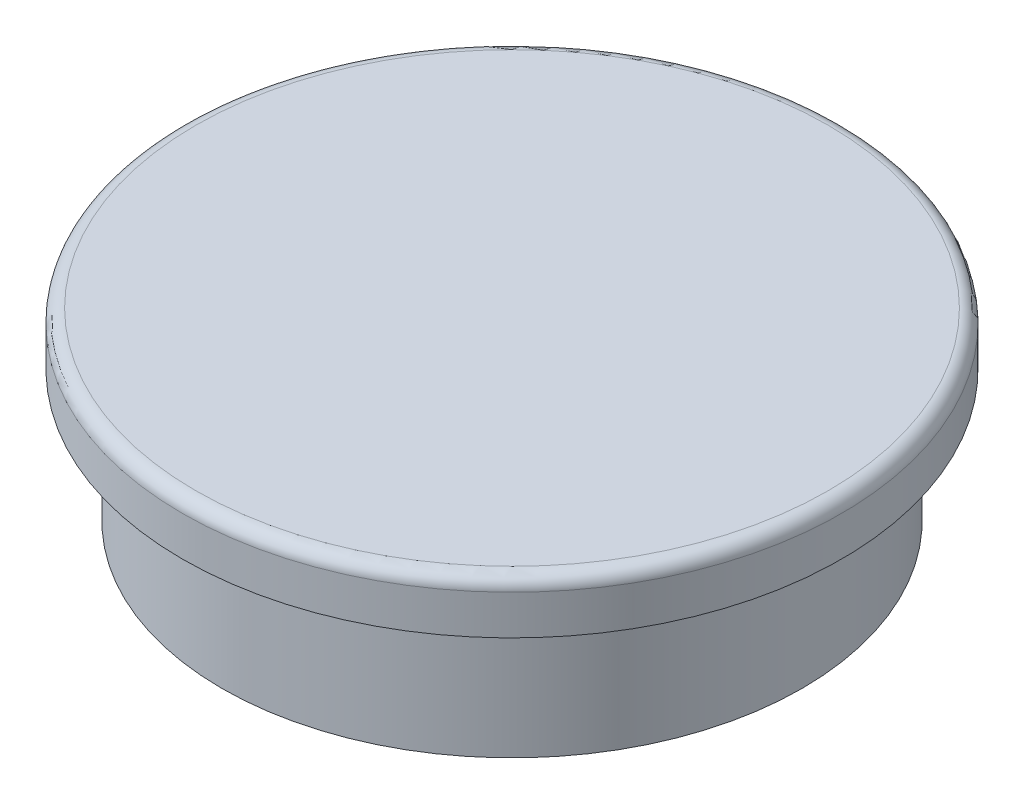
from build123d import *

# Parameters (mm, degrees)
SKIZZE1_R                       = 11
AUFSATZ_LINEAR_AUSTRAGEN1_DEPTH = 5
SKIZZE2_R                       = 12.5
AUFSATZ_LINEAR_AUSTRAGEN2_DEPTH = 2
VERRUNDUNG1_R                   = 0.5


with BuildPart() as part:
    # Skizze1 → Aufsatz-Linear austragen1 (new body)
    with BuildSketch(Plane(origin=(0, 0, 0), x_dir=(1, 0, 0), z_dir=(0, 1, 0))):
        with Locations(Location((0, 0, 0), (0, 0, 270))):
            Circle(SKIZZE1_R)
    extrude(amount=AUFSATZ_LINEAR_AUSTRAGEN1_DEPTH)

    # Skizze2 → Aufsatz-Linear austragen2 (add)
    with BuildSketch(Plane(origin=(0, 5, 0), x_dir=(1, 0, 0), z_dir=(0, 1, 0))):
        with Locations(Location((0, 0, 0), (0, 0, 270))):
            Circle(SKIZZE2_R)
    extrude(amount=AUFSATZ_LINEAR_AUSTRAGEN2_DEPTH)

    # Verrundung1
    verrundung1_edges = [part.edges().sort_by_distance(p)[0] for p in [
        (0, 7, -12.5),
    ]]
    fillet(verrundung1_edges, radius=VERRUNDUNG1_R)


solid = part.part
